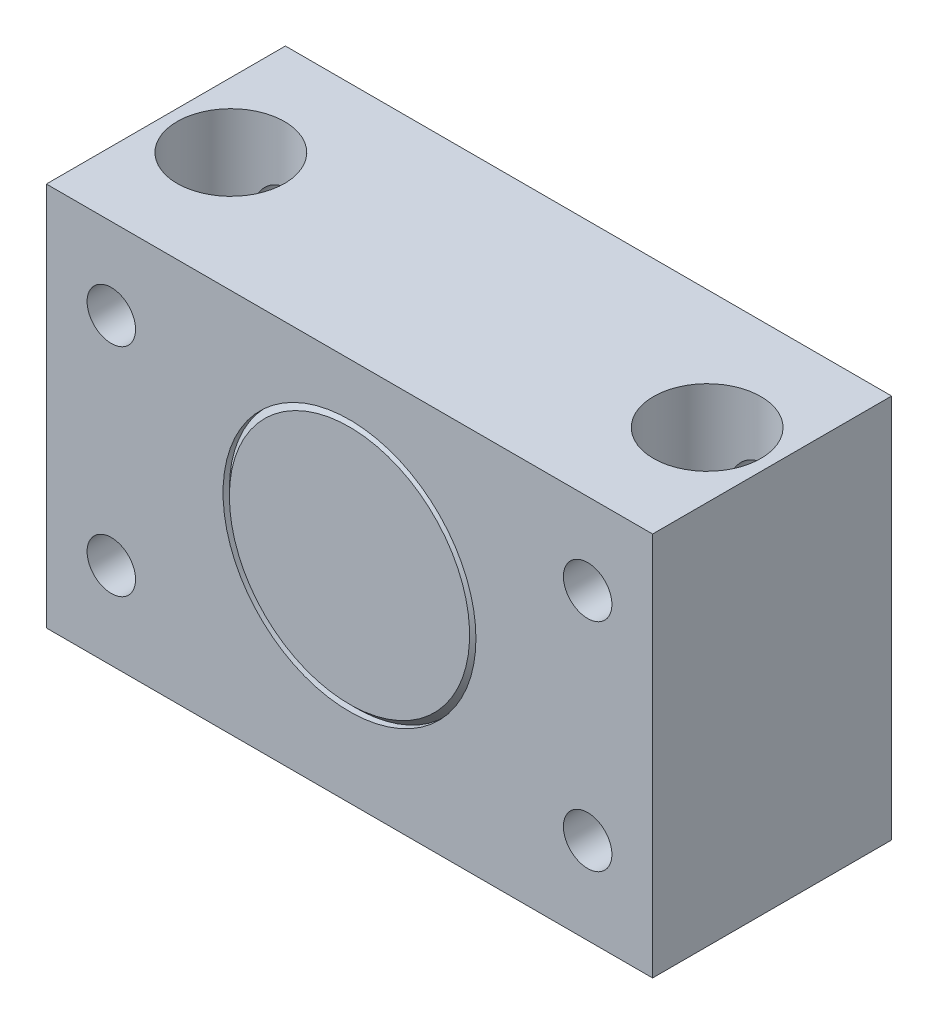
from build123d import *

# Parameters (mm, degrees)
SKETCH1_W          = 88.9
SKETCH1_H          = 35.052
EXTRUDE_B_DEPTH    = 56.388
SKETCH2_R          = 5.207
PHOLES_DEPTH       = 111.957015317
SKETCH3_R          = 7.874
PCBOREDDEPTH_DEPTH = 25.4
SKETCH4_R          = 3.556
CUT_EXTRUDE3_DEPTH = 111.957015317
SKETCH5_R          = 18.542
CUT_EXTRUDE4_DEPTH = 111.957015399
SKETCH11_W         = 11.938
SKETCH11_H         = 8.542


with BuildPart() as part:
    # Sketch1 → Extrude B (new body)
    with BuildSketch(Plane(origin=(0, 0, 0), x_dir=(1, 0, 0), z_dir=(0, 1, 0))):
        with Locations((44.45, 17.526)):
            Rectangle(SKETCH1_W, SKETCH1_H)
    extrude(amount=EXTRUDE_B_DEPTH)

    # Sketch2 → PHoles (cut, through all)
    with BuildSketch(Plane(origin=(0, 56.388, 0), x_dir=(-1, 0, 0), z_dir=(0, 1, 0))):
        with Locations(Location((-79.375, -17.526, 0), (0, 0, 90))):
            Circle(SKETCH2_R)
        with Locations(Location((-9.525, -17.526, 0), (0, 0, 90))):
            Circle(SKETCH2_R)
        with Locations((-79.375, 25.908)):
            Circle(SKETCH2_R)
        with Locations((-9.525, 25.908)):
            Circle(SKETCH2_R)
    extrude(amount=-PHOLES_DEPTH, mode=Mode.SUBTRACT)

    # Sketch3 → PcBoredDepth (cut)
    with BuildSketch(Plane(origin=(0, 56.388, 0), x_dir=(-1, 0, 0), z_dir=(0, 1, 0))):
        with Locations(Location((-9.525, -17.526, 0), (0, 0, 90))):
            Circle(SKETCH3_R)
        with Locations(Location((-79.375, -17.526, 0), (0, 0, 90))):
            Circle(SKETCH3_R)
        with Locations((-79.375, 25.908)):
            Circle(SKETCH3_R)
        with Locations((-9.525, 25.908)):
            Circle(SKETCH3_R)
    extrude(amount=-PCBOREDDEPTH_DEPTH, mode=Mode.SUBTRACT)

    # Sketch4 → Cut-Extrude3 (cut, through all)
    with BuildSketch(Plane.XY):
        with Locations((9.525, 44.45)):
            Circle(SKETCH4_R)
        with Locations((9.525, 12.7)):
            Circle(SKETCH4_R)
        with Locations((79.375, 44.45)):
            Circle(SKETCH4_R)
        with Locations((79.375, 12.7)):
            Circle(SKETCH4_R)
        with Locations((9.525, 76.2)):
            Circle(SKETCH4_R)
        with Locations((79.375, 76.2)):
            Circle(SKETCH4_R)
    extrude(amount=-CUT_EXTRUDE3_DEPTH, mode=Mode.SUBTRACT)

    # Sketch5 → Cut-Extrude4 (cut, through all)
    with BuildSketch(Plane.XY):
        with Locations((44.45, 30.1498)):
            Circle(SKETCH5_R)
    extrude(amount=-CUT_EXTRUDE4_DEPTH, mode=Mode.SUBTRACT)

    # Sketch11 → Revolve1 (revolve)
    with BuildSketch(Plane.ZY.offset(-44.45), mode=Mode.PRIVATE) as revolve1_sk:
        with Locations((-20.701, 44.4208)):
            Rectangle(SKETCH11_W, SKETCH11_H)
        Polygon((-0.9271, 48.6918), (0, 47.7647), (0, 30.1498), (-3.81, 30.1498), (-3.81, 48.6918), align=None)
    revolve(revolve1_sk.sketch.rotate(Axis((44.45, 30.1498, -35.052), (0, 0, 1)), 270), axis=Axis((44.45, 30.1498, -35.052), (0, 0, 1)))


solid = part.part
